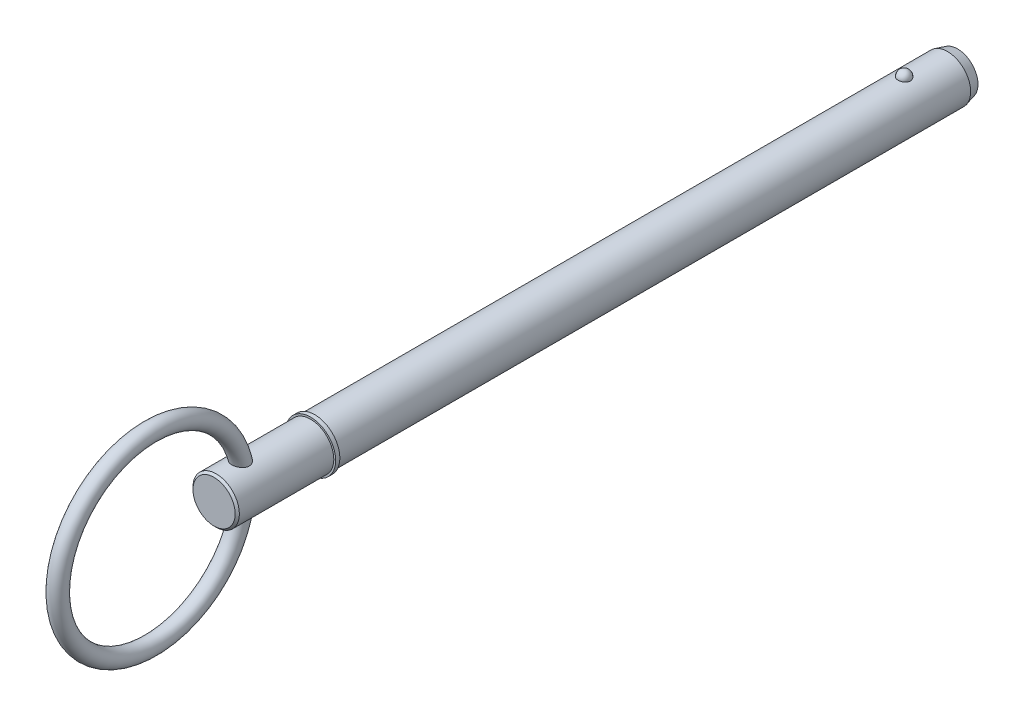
from build123d import *

# Parameters (mm, degrees)
SKETCH2_R           = 5.555
BOSS_EXTRUDE1_DEPTH = 139.7
BOSS_EXTRUDE2_START = 14.27
SKETCH3_R           = 5.555
BOSS_EXTRUDE2_DEPTH = 14.27
CHAMFER1_SIZE       = 2.4
CHAMFER1_SIZE2      = 0.643078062
SKETCH20_W          = 1
SKETCH20_H          = 6
SKETCH21_R          = 5.555
BOSS_EXTRUDE3_DEPTH = 24.13
CHAMFER2_SIZE       = 0.5
SKETCH24_R          = 2


with BuildPart() as part:
    # Sketch2 → Boss-Extrude1 (new body)
    with BuildSketch(Plane.XY):
        Circle(SKETCH2_R)
    extrude(amount=BOSS_EXTRUDE1_DEPTH)

    # Sketch3 → Boss-Extrude2 (add)
    with BuildSketch(Plane(origin=(0, 0, 0), x_dir=(-1, 0, 0), z_dir=(0, 0, -1)).offset(BOSS_EXTRUDE2_START)):
        Circle(SKETCH3_R)
    extrude(amount=-BOSS_EXTRUDE2_DEPTH)

    # Chamfer1
    chamfer1_edges = [part.edges().sort_by_distance(p)[0] for p in [
        (5.555, 0, -14.27),
    ]]
    chamfer1_side = [part.faces().sort_by_distance(p)[0] for p in [
        (5.555, 0, -7.135),
    ]]
    chamfer(chamfer1_edges, length=CHAMFER1_SIZE, length2=CHAMFER1_SIZE2, reference=chamfer1_side[0])

    # Sketch18 → Revolve1 (revolve)
    with BuildSketch(Plane(origin=(0, 0, 0), x_dir=(0, 0, -1), z_dir=(1, 0, 0))):
        with BuildLine():
            Line((1.49, 7.045), (1.49, 4.065))
            ThreePointArc((1.49, 4.065), (0, 5.555), (1.49, 7.045))
        make_face()
    revolve(axis=Axis((0, 7.045, -1.49), (0, -1, 0)))

    # Sketch20 → Revolve2 (revolve)
    with BuildSketch(Plane(origin=(0, 0, 0), x_dir=(0, 0, -1), z_dir=(1, 0, 0)), mode=Mode.PRIVATE) as revolve2_sk:
        with Locations((-140.2, 3)):
            Rectangle(SKETCH20_W, SKETCH20_H)
    revolve(revolve2_sk.sketch.rotate(Axis((0, 0, 33.728787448), (0, 0, 1)), 270), axis=Axis((0, 0, 33.728787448), (0, 0, 1)))

    # Sketch21 → Boss-Extrude3 (add)
    with BuildSketch(Plane(origin=(0, 0, 139.7), x_dir=(-1, 0, 0), z_dir=(0, 0, -1))):
        with Locations(Location((0, 0, 0), (0, 0, 180))):
            Circle(SKETCH21_R)
    extrude(amount=-BOSS_EXTRUDE3_DEPTH)

    # Chamfer2
    chamfer2_edges = [part.edges().sort_by_distance(p)[0] for p in [
        (-5.555, 0, 163.83),
    ]]
    chamfer(chamfer2_edges, length=CHAMFER2_SIZE)

    # Sweep1: sweep along a path in Sketch23
    with BuildLine(Plane(origin=(0, 0, 0), x_dir=(0, 0, -1), z_dir=(1, 0, 0))) as sweep1_path:
        CenterArc((-179.055, 0), 22.225, 0, 360)
    # Sketch24 → Sweep1 (sweep)
    with BuildSketch(Plane(origin=(0, 0, 0), x_dir=(1, 0, 0), z_dir=(0, 1, 0))):
        with Locations((0, -156.83)):
            Circle(SKETCH24_R)
    sweep(path=sweep1_path.line)


solid = part.part
